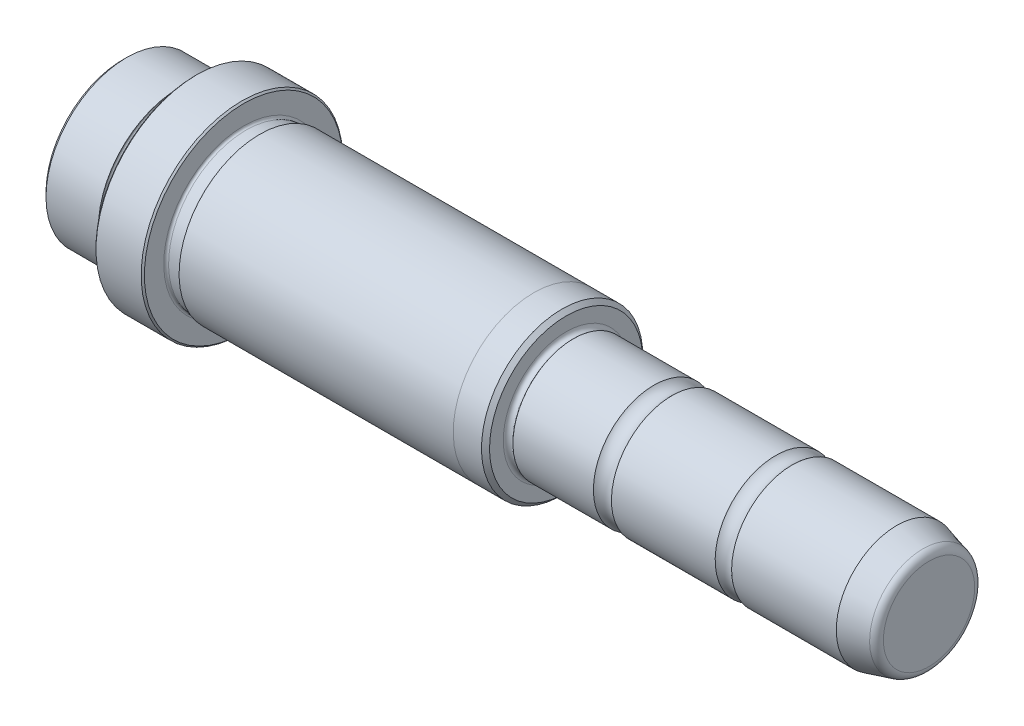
from build123d import *

# Parameters (mm, degrees)
FILLET1_R     = 1
CHAMFER1_SIZE = 0.2
CHAMFER2_SIZE = 0.5


with BuildPart() as part:
    # Sketch1 → Revolve1 (revolve)
    with BuildSketch(Plane.XY):
        with BuildLine():
            Line((45, 6.42820323), (41, 7.5))
            Line((41, 7.5), (0.9, 7.5))
            ThreePointArc((0.9, 7.5), (0.341886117, 7.325658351), (0, 7.8))
            Line((0, 7.8), (0, 10))
            Line((0, 10), (-4, 10))
            Line((-4, 10), (-38, 10.0001))
            Line((-38, 10.0001), (-38, 9.9))
            ThreePointArc((-38, 9.9), (-38.087867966, 9.687867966), (-38.3, 9.6))
            Line((-38.3, 9.6), (-39.7, 9.6))
            ThreePointArc((-39.7, 9.6), (-39.912132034, 9.687867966), (-40, 9.9))
            Line((-40, 9.9), (-40, 12.5))
            Line((-40, 12.5), (-46, 12.5))
            Line((-46, 12.5), (-46, 9.9))
            ThreePointArc((-46, 9.9), (-46.087867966, 9.687867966), (-46.3, 9.6))
            Line((-46.3, 9.6), (-47.7, 9.6))
            ThreePointArc((-47.7, 9.6), (-47.912132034, 9.687867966), (-48, 9.9))
            Line((-48, 9.9), (-48, 10))
            Line((-48, 10), (-55, 10))
            Line((-55, 10), (-55, 0))
            Line((-55, 0), (45, 0))
            Line((45, 0), (45, 6.42820323))
        make_face()
    revolve(axis=Axis((45, 0, 0), (-1, 0, 0)))

    # Sketch2 → Groove A (revolve, cut)
    with BuildSketch(Plane.XY):
        with BuildLine():
            Line((25.980196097, 7.5), (28.019803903, 7.5))
            ThreePointArc((28.019803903, 7.5), (27, 7.1), (25.980196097, 7.5))
        make_face()
    revolve(axis=Axis((45, 0, 0), (1, 0, 0)), mode=Mode.SUBTRACT)

    # Sketch3 → Groove B (revolve, cut)
    with BuildSketch(Plane.XY, mode=Mode.PRIVATE) as groove_b_sk:
        with BuildLine():
            Line((10.881966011, 7.5), (13.118033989, 7.5))
            ThreePointArc((13.118033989, 7.5), (12, 7), (10.881966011, 7.5))
        make_face()
    revolve(groove_b_sk.sketch.rotate(Axis((45, 0, 0), (1, 0, 0)), 180), axis=Axis((45, 0, 0), (1, 0, 0)), mode=Mode.SUBTRACT)

    # Fillet1
    fillet1_edges = [part.edges().sort_by_distance(p)[0] for p in [
        (45, -6.42820323, 0),
    ]]
    fillet(fillet1_edges, radius=FILLET1_R)

    # Chamfer1
    chamfer1_edges = [part.edges().sort_by_distance(p)[0] for p in [
        (-40, -12.5, 0),
        (-46, -12.5, 0),
    ]]
    chamfer(chamfer1_edges, length=CHAMFER1_SIZE)

    # Chamfer2
    chamfer2_edges = [part.edges().sort_by_distance(p)[0] for p in [
        (0, -10, 0),
        (-55, -10, 0),
    ]]
    chamfer(chamfer2_edges, length=CHAMFER2_SIZE)


solid = part.part
